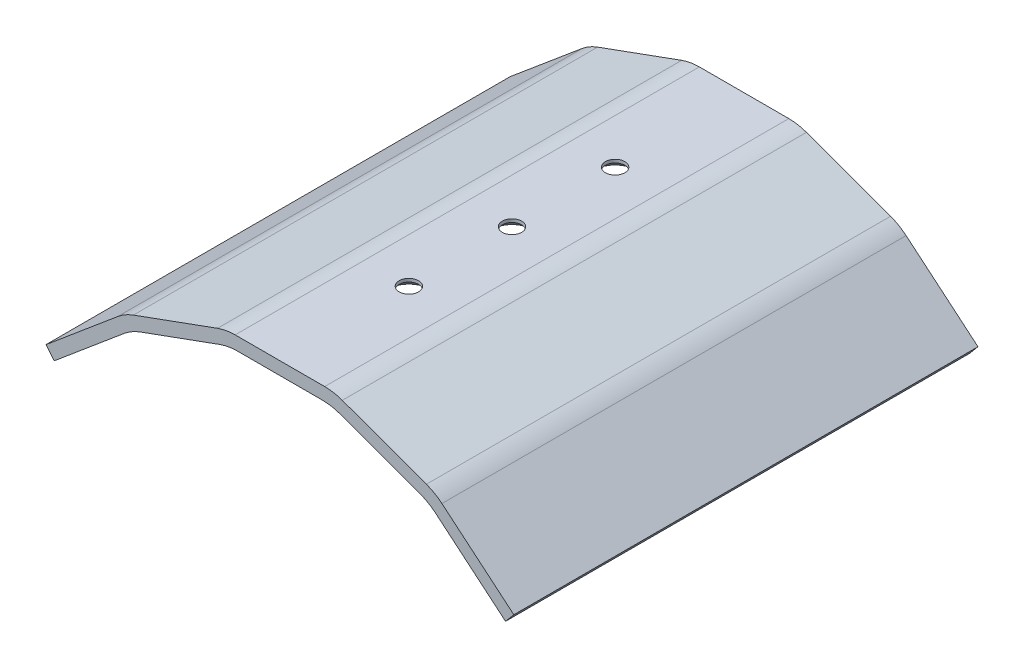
from build123d import *
from OCP.BRepFilletAPI import BRepFilletAPI_MakeChamfer

# Parameters (mm, degrees)
BOSS_EXTRUDE1_DEPTH = 114.3
FILLET1_R           = 12.7
SKETCH2_R           = 2.3876
CUT_EXTRUDE1_DEPTH  = 25.4
CHAMFER1_SIZE       = 2.3876
CHAMFER1_SIZE2      = 2.746619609


with BuildPart() as part:
    # Sketch1 → Boss-Extrude1 (new body)
    with BuildSketch(Plane.XY):
        Polygon((0, 0), (12.7, 0), (36.568192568, -8.68731164), (55.5625, -24.625428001), (57.603350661, -22.193236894), (38.180182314, -5.895263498), (13.259838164, 3.175), (-13.259838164, 3.175), (-38.180182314, -5.895263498), (-57.603350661, -22.193236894), (-55.5625, -24.625428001), (-36.568192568, -8.68731164), (-12.7, 0), align=None)
    extrude(amount=BOSS_EXTRUDE1_DEPTH)

    # Fillet1
    fillet1_edges = [part.edges().sort_by_distance(p)[0] for p in [
        (-12.7, 0, 57.15),
        (-36.568192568, -8.68731164, 57.15),
        (-38.180182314, -5.895263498, 57.15),
        (-13.259838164, 3.175, 57.15),
        (13.259838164, 3.175, 57.15),
        (38.180182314, -5.895263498, 57.15),
        (36.568192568, -8.68731164, 57.15),
        (12.7, 0, 57.15),
    ]]
    fillet(fillet1_edges, radius=FILLET1_R)

    # Sketch2 → Cut-Extrude1 (cut)
    with BuildSketch(Plane(origin=(0, 0, 0), x_dir=(1, 0, 0), z_dir=(0, 1, 0))):
        with Locations(Location((0, -31.75, 0), (0, 0, 90))):
            Circle(SKETCH2_R)
        with Locations(Location((0, -57.15, 0), (0, 0, 90))):
            Circle(SKETCH2_R)
        with Locations(Location((0, -82.55, 0), (0, 0, 90))):
            Circle(SKETCH2_R)
    extrude(amount=CUT_EXTRUDE1_DEPTH, mode=Mode.SUBTRACT)

    # Chamfer1: one chamfer whose edges measure the first distance from different faces: ONE call of the kernel's chamfer builder (chamfer() names one face for all edges)
    chamfer1_edges_1 = [part.edges().sort_by_distance(p)[0] for p in [
        (0, 0, 34.1376),
    ]]
    chamfer1_side_1 = [part.faces().sort_by_distance(p)[0] for p in [
        (0, 1.5875, 34.1376),
    ]]
    chamfer1_edges_2 = [part.edges().sort_by_distance(p)[0] for p in [
        (0, 0, 59.5376),
    ]]
    chamfer1_side_2 = [part.faces().sort_by_distance(p)[0] for p in [
        (0, 1.5875, 59.5376),
    ]]
    chamfer1_edges_3 = [part.edges().sort_by_distance(p)[0] for p in [
        (0, 0, 84.9376),
    ]]
    chamfer1_side_3 = [part.faces().sort_by_distance(p)[0] for p in [
        (0, 1.5875, 84.9376),
    ]]
    chamfer1 = BRepFilletAPI_MakeChamfer(part.part.solid().wrapped)
    for e in chamfer1_edges_1:
        chamfer1.Add(CHAMFER1_SIZE, CHAMFER1_SIZE2, e.wrapped, chamfer1_side_1[0].wrapped)  # the first distance lies on this face
    for e in chamfer1_edges_2:
        chamfer1.Add(CHAMFER1_SIZE, CHAMFER1_SIZE2, e.wrapped, chamfer1_side_2[0].wrapped)  # the first distance lies on this face
    for e in chamfer1_edges_3:
        chamfer1.Add(CHAMFER1_SIZE, CHAMFER1_SIZE2, e.wrapped, chamfer1_side_3[0].wrapped)  # the first distance lies on this face
    add(Compound.cast(chamfer1.Shape()), mode=Mode.REPLACE)


solid = part.part
